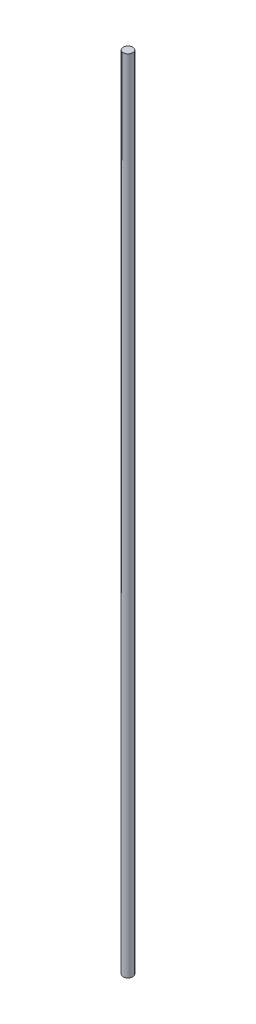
from build123d import *

# Parameters (mm, degrees)
ESQUISSE1_R      = 6
EXTRUSION1_DEPTH = 500


with BuildPart() as part:
    # Esquisse1 → Extrusion1 (new, symmetric)
    with BuildSketch(Plane(origin=(0, 0, 0), x_dir=(1, 0, 0), z_dir=(0, 1, 0))):
        with Locations(Location((0, 0, 0), (0, 0, 270))):
            Circle(ESQUISSE1_R)
    extrude(amount=EXTRUSION1_DEPTH, both=True)


solid = part.part
